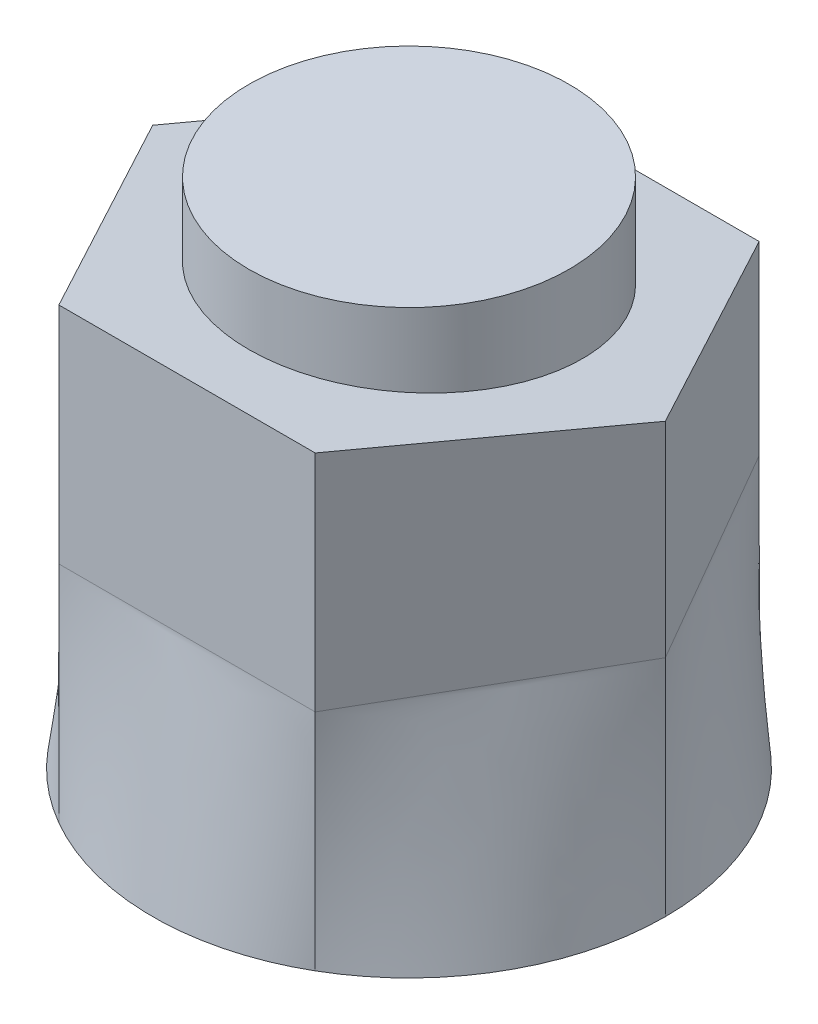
ISO-10303-21;
HEADER;
FILE_DESCRIPTION(('STEP AP214'),'2;1');
FILE_NAME('part.step','',(''),(''),'','','');
FILE_SCHEMA(('AUTOMOTIVE_DESIGN { 1 0 10303 214 1 1 1 1 }'));
ENDSEC;
DATA;
#1=APPLICATION_CONTEXT('core data for automotive mechanical design processes');
#2=APPLICATION_PROTOCOL_DEFINITION('international standard','automotive_design',2000,#1);
#3=PRODUCT_CONTEXT('',#1,'mechanical');
#4=PRODUCT('Part','Part','',(#3));
#5=PRODUCT_RELATED_PRODUCT_CATEGORY('part','',(#4));
#6=PRODUCT_DEFINITION_FORMATION('','',#4);
#7=PRODUCT_DEFINITION_CONTEXT('part definition',#1,'design');
#8=PRODUCT_DEFINITION('design','',#6,#7);
#9=PRODUCT_DEFINITION_SHAPE('','',#8);
#10=(LENGTH_UNIT() NAMED_UNIT(*) SI_UNIT(.MILLI.,.METRE.));
#11=(NAMED_UNIT(*) PLANE_ANGLE_UNIT() SI_UNIT($,.RADIAN.));
#12=(NAMED_UNIT(*) SI_UNIT($,.STERADIAN.) SOLID_ANGLE_UNIT());
#13=UNCERTAINTY_MEASURE_WITH_UNIT(LENGTH_MEASURE(1.E-05),#10,'distance_accuracy_value','');
#14=(GEOMETRIC_REPRESENTATION_CONTEXT(3) GLOBAL_UNCERTAINTY_ASSIGNED_CONTEXT((#13)) GLOBAL_UNIT_ASSIGNED_CONTEXT((#10,
#11,#12)) REPRESENTATION_CONTEXT('',''));
#15=CARTESIAN_POINT('',(0.,0.,0.));
#16=DIRECTION('',(0.,0.,1.));
#17=DIRECTION('',(1.,0.,0.));
#18=AXIS2_PLACEMENT_3D('',#15,#16,#17);
#19=CARTESIAN_POINT('',(0.,0.,0.));
#20=DIRECTION('',(0.,1.,0.));
#21=DIRECTION('',(0.,0.,1.));
#22=AXIS2_PLACEMENT_3D('',#19,#20,#21);
#23=PLANE('',#22);
#24=CARTESIAN_POINT('',(0.,0.,0.));
#25=DIRECTION('',(0.,1.,0.));
#26=DIRECTION('',(0.,0.,1.));
#27=AXIS2_PLACEMENT_3D('',#24,#25,#26);
#28=CIRCLE('',#27,40.);
#29=CARTESIAN_POINT('',(19.9999999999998,0.,-34.6410161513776));
#30=VERTEX_POINT('',#29);
#31=CARTESIAN_POINT('',(-20.0000000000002,0.,-34.6410161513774));
#32=VERTEX_POINT('',#31);
#33=EDGE_CURVE('E302',#30,#32,#28,.T.);
#34=ORIENTED_EDGE('',*,*,#33,.F.);
#35=CARTESIAN_POINT('',(40.,0.,0.));
#36=VERTEX_POINT('',#35);
#37=EDGE_CURVE('E182',#36,#30,#28,.T.);
#38=ORIENTED_EDGE('',*,*,#37,.F.);
#39=CARTESIAN_POINT('',(20.0000000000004,0.,34.6410161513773));
#40=VERTEX_POINT('',#39);
#41=EDGE_CURVE('E284',#40,#36,#28,.T.);
#42=ORIENTED_EDGE('',*,*,#41,.F.);
#43=CARTESIAN_POINT('',(-19.9999999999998,0.,34.6410161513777));
#44=VERTEX_POINT('',#43);
#45=EDGE_CURVE('E292',#44,#40,#28,.T.);
#46=ORIENTED_EDGE('',*,*,#45,.F.);
#47=CARTESIAN_POINT('',(-40.,0.,2.05814939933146E-13));
#48=VERTEX_POINT('',#47);
#49=EDGE_CURVE('E307',#48,#44,#28,.T.);
#50=ORIENTED_EDGE('',*,*,#49,.F.);
#51=EDGE_CURVE('E306',#32,#48,#28,.T.);
#52=ORIENTED_EDGE('',*,*,#51,.F.);
#53=EDGE_LOOP('',(#34,#38,#42,#46,#50,#52));
#54=FACE_BOUND('',#53,.T.);
#55=ADVANCED_FACE('F81',(#54),#23,.F.);
#56=CARTESIAN_POINT('',(-40.,0.,2.05814939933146E-13));
#57=CARTESIAN_POINT('',(-40.,35.,2.77555756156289E-13));
#58=CARTESIAN_POINT('',(-40.,0.,1.66666666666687));
#59=CARTESIAN_POINT('',(-39.1666666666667,35.,1.44337567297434));
#60=CARTESIAN_POINT('',(-39.8954654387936,0.,3.36152931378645));
#61=CARTESIAN_POINT('',(-38.3333333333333,35.,2.88675134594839));
#62=CARTESIAN_POINT('',(-39.4606647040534,0.,6.76786399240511));
#63=CARTESIAN_POINT('',(-36.6666666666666,35.,5.77350269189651));
#64=CARTESIAN_POINT('',(-39.1303205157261,0.,8.47923612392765));
#65=CARTESIAN_POINT('',(-35.8333333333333,35.,7.21687836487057));
#66=CARTESIAN_POINT('',(-38.2374342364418,0.,11.8734178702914));
#67=CARTESIAN_POINT('',(-34.1666666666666,35.,10.1036297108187));
#68=CARTESIAN_POINT('',(-37.6748556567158,0.,13.5560972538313));
#69=CARTESIAN_POINT('',(-33.3333333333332,35.,11.5470053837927));
#70=CARTESIAN_POINT('',(-36.3232199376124,0.,16.8459554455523));
#71=CARTESIAN_POINT('',(-31.6666666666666,35.,14.4337567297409));
#72=CARTESIAN_POINT('',(-35.5341801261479,0.,18.4529946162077));
#73=CARTESIAN_POINT('',(-30.8333333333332,35.,15.8771324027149));
#74=CARTESIAN_POINT('',(-33.747852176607,0.,21.5470053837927));
#75=CARTESIAN_POINT('',(-29.1666666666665,35.,18.763883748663));
#76=CARTESIAN_POINT('',(-32.750635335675,0.,23.033853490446));
#77=CARTESIAN_POINT('',(-28.3333333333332,35.,20.2072594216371));
#78=CARTESIAN_POINT('',(-30.5773524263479,0.,25.8493334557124));
#79=CARTESIAN_POINT('',(-26.6666666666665,35.,23.0940107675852));
#80=CARTESIAN_POINT('',(-29.4013986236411,0.,27.1778804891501));
#81=CARTESIAN_POINT('',(-25.8333333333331,35.,24.5373864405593));
#82=CARTESIAN_POINT('',(-26.9083941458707,0.,29.6482335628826));
#83=CARTESIAN_POINT('',(-24.1666666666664,35.,27.4241377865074));
#84=CARTESIAN_POINT('',(-25.5914744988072,0.,30.790006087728));
#85=CARTESIAN_POINT('',(-23.3333333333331,35.,28.8675134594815));
#86=CARTESIAN_POINT('',(-22.8589025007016,0.,32.8697219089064));
#87=CARTESIAN_POINT('',(-21.6666666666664,35.,31.7542648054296));
#88=CARTESIAN_POINT('',(-21.4433756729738,0.,33.8076828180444));
#89=CARTESIAN_POINT('',(-20.833333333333,35.,33.1976404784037));
#90=CARTESIAN_POINT('',(-19.9999999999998,0.,34.6410161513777));
#91=CARTESIAN_POINT('',(-19.9999999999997,35.,34.6410161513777));
#92=B_SPLINE_SURFACE_WITH_KNOTS('',3,1,((#56,#57),(#58,#59),(#60,#61),(#62,#63),(#64,#65),(#66,
#67),(#68,#69),(#70,#71),(#72,#73),(#74,#75),(#76,#77),(#78,#79),(#80,#81),(#82,#83),(#84,#85),
(#86,#87),(#88,#89),(#90,#91)),.UNSPECIFIED.,.F.,.F.,.F.,(4,2,2,2,2,2,2,2,4),(2,2),(0.,0.125,
0.25,0.375,0.5,0.625,0.75,0.875,1.),(0.,1.),.UNSPECIFIED.);
#93=DIRECTION('',(0.,1.,0.));
#94=VECTOR('',#93,1.);
#95=CARTESIAN_POINT('',(-19.9999999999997,17.5,34.6410161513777));
#96=LINE('',#95,#94);
#97=CARTESIAN_POINT('',(-19.9999999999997,35.,34.6410161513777));
#98=VERTEX_POINT('',#97);
#99=EDGE_CURVE('E98',#44,#98,#96,.T.);
#100=DIRECTION('',(0.500000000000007,0.,0.866025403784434));
#101=VECTOR('',#100,1.);
#102=CARTESIAN_POINT('',(-40.,35.,2.77555756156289E-13));
#103=LINE('',#102,#101);
#104=CARTESIAN_POINT('',(-40.,35.,2.77555756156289E-13));
#105=VERTEX_POINT('',#104);
#106=EDGE_CURVE('E330',#105,#98,#103,.T.);
#107=DIRECTION('',(0.,-1.,0.));
#108=VECTOR('',#107,1.);
#109=CARTESIAN_POINT('',(-40.,17.5,2.41685348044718E-13));
#110=LINE('',#109,#108);
#111=EDGE_CURVE('E317',#105,#48,#110,.T.);
#112=ORIENTED_EDGE('',*,*,#49,.T.);
#113=ORIENTED_EDGE('',*,*,#99,.T.);
#114=ORIENTED_EDGE('',*,*,#106,.F.);
#115=ORIENTED_EDGE('',*,*,#111,.T.);
#116=EDGE_LOOP('',(#112,#113,#114,#115));
#117=FACE_BOUND('',#116,.T.);
#118=ADVANCED_FACE('F246',(#117),#92,.T.);
#119=CARTESIAN_POINT('',(-19.9999999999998,0.,34.6410161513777));
#120=CARTESIAN_POINT('',(-19.9999999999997,35.,34.6410161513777));
#121=CARTESIAN_POINT('',(-18.5566243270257,0.,35.474349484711));
#122=CARTESIAN_POINT('',(-18.333333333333,35.,34.6410161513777));
#123=CARTESIAN_POINT('',(-17.0365629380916,0.,36.2312512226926));
#124=CARTESIAN_POINT('',(-16.6666666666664,35.,34.6410161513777));
#125=CARTESIAN_POINT('',(-13.8691902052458,0.,37.5578700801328));
#126=CARTESIAN_POINT('',(-13.333333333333,35.,34.6410161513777));
#127=CARTESIAN_POINT('',(-12.2219263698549,0.,38.12746968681));
#128=CARTESIAN_POINT('',(-11.6666666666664,35.,34.6410161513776));
#129=CARTESIAN_POINT('',(-8.83603561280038,0.,39.0512983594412));
#130=CARTESIAN_POINT('',(-8.33333333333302,35.,34.6410161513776));
#131=CARTESIAN_POINT('',(-7.09750323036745,0.,39.4054307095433));
#132=CARTESIAN_POINT('',(-6.66666666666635,35.,34.6410161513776));
#133=CARTESIAN_POINT('',(-3.57258460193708,0.,39.8798089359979));
#134=CARTESIAN_POINT('',(-3.33333333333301,35.,34.6410161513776));
#135=CARTESIAN_POINT('',(-1.78632794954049,0.,40.));
#136=CARTESIAN_POINT('',(-1.66666666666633,35.,34.6410161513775));
#137=CARTESIAN_POINT('',(1.78632794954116,0.,40.));
#138=CARTESIAN_POINT('',(1.66666666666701,35.,34.6410161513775));
#139=CARTESIAN_POINT('',(3.57258460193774,0.,39.8798089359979));
#140=CARTESIAN_POINT('',(3.33333333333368,35.,34.6410161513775));
#141=CARTESIAN_POINT('',(7.09750323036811,0.,39.4054307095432));
#142=CARTESIAN_POINT('',(6.66666666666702,35.,34.6410161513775));
#143=CARTESIAN_POINT('',(8.83603561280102,0.,39.051298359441));
#144=CARTESIAN_POINT('',(8.33333333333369,35.,34.6410161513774));
#145=CARTESIAN_POINT('',(12.2219263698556,0.,38.1274696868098));
#146=CARTESIAN_POINT('',(11.666666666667,35.,34.6410161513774));
#147=CARTESIAN_POINT('',(13.8691902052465,0.,37.5578700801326));
#148=CARTESIAN_POINT('',(13.3333333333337,35.,34.6410161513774));
#149=CARTESIAN_POINT('',(17.0365629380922,0.,36.2312512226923));
#150=CARTESIAN_POINT('',(16.6666666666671,35.,34.6410161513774));
#151=CARTESIAN_POINT('',(18.5566243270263,0.,35.4743494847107));
#152=CARTESIAN_POINT('',(18.3333333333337,35.,34.6410161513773));
#153=CARTESIAN_POINT('',(20.0000000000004,0.,34.6410161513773));
#154=CARTESIAN_POINT('',(20.0000000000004,35.,34.6410161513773));
#155=B_SPLINE_SURFACE_WITH_KNOTS('',3,1,((#119,#120),(#121,#122),(#123,#124),(#125,#126),(#127,
#128),(#129,#130),(#131,#132),(#133,#134),(#135,#136),(#137,#138),(#139,#140),(#141,#142),(#143,
#144),(#145,#146),(#147,#148),(#149,#150),(#151,#152),(#153,#154)),.UNSPECIFIED.,.F.,.F.,.F.,(4,
2,2,2,2,2,2,2,4),(2,2),(0.,0.125,0.25,0.375,0.5,0.625,0.75,0.875,1.),(0.,1.),.UNSPECIFIED.);
#156=DIRECTION('',(0.,1.,0.));
#157=VECTOR('',#156,1.);
#158=CARTESIAN_POINT('',(20.0000000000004,17.5,34.6410161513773));
#159=LINE('',#158,#157);
#160=CARTESIAN_POINT('',(20.0000000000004,35.,34.6410161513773));
#161=VERTEX_POINT('',#160);
#162=EDGE_CURVE('E126',#40,#161,#159,.T.);
#163=DIRECTION('',(1.,0.,0.));
#164=VECTOR('',#163,1.);
#165=CARTESIAN_POINT('',(-19.9999999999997,35.,34.6410161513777));
#166=LINE('',#165,#164);
#167=EDGE_CURVE('E90',#98,#161,#166,.T.);
#168=ORIENTED_EDGE('',*,*,#45,.T.);
#169=ORIENTED_EDGE('',*,*,#162,.T.);
#170=ORIENTED_EDGE('',*,*,#167,.F.);
#171=ORIENTED_EDGE('',*,*,#99,.F.);
#172=EDGE_LOOP('',(#168,#169,#170,#171));
#173=FACE_BOUND('',#172,.T.);
#174=ADVANCED_FACE('F354',(#173),#155,.T.);
#175=CARTESIAN_POINT('',(-20.0000000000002,0.,-34.6410161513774));
#176=CARTESIAN_POINT('',(-20.0000000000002,35.,-34.6410161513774));
#177=CARTESIAN_POINT('',(-21.4433756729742,0.,-33.8076828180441));
#178=CARTESIAN_POINT('',(-20.8333333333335,35.,-33.1976404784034));
#179=CARTESIAN_POINT('',(-22.858902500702,0.,-32.8697219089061));
#180=CARTESIAN_POINT('',(-21.6666666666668,35.,-31.7542648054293));
#181=CARTESIAN_POINT('',(-25.5914744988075,0.,-30.7900060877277));
#182=CARTESIAN_POINT('',(-23.3333333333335,35.,-28.8675134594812));
#183=CARTESIAN_POINT('',(-26.9083941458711,0.,-29.6482335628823));
#184=CARTESIAN_POINT('',(-24.1666666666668,35.,-27.4241377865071));
#185=CARTESIAN_POINT('',(-29.4013986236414,0.,-27.1778804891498));
#186=CARTESIAN_POINT('',(-25.8333333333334,35.,-24.5373864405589));
#187=CARTESIAN_POINT('',(-30.5773524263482,0.,-25.8493334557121));
#188=CARTESIAN_POINT('',(-26.6666666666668,35.,-23.0940107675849));
#189=CARTESIAN_POINT('',(-32.7506353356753,0.,-23.0338534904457));
#190=CARTESIAN_POINT('',(-28.3333333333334,35.,-20.2072594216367));
#191=CARTESIAN_POINT('',(-33.7478521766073,0.,-21.5470053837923));
#192=CARTESIAN_POINT('',(-29.1666666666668,35.,-18.7638837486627));
#193=CARTESIAN_POINT('',(-35.5341801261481,0.,-18.4529946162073));
#194=CARTESIAN_POINT('',(-30.8333333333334,35.,-15.8771324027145));
#195=CARTESIAN_POINT('',(-36.3232199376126,0.,-16.8459554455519));
#196=CARTESIAN_POINT('',(-31.6666666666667,35.,-14.4337567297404));
#197=CARTESIAN_POINT('',(-37.6748556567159,0.,-13.5560972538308));
#198=CARTESIAN_POINT('',(-33.3333333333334,35.,-11.5470053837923));
#199=CARTESIAN_POINT('',(-38.237434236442,0.,-11.873417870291));
#200=CARTESIAN_POINT('',(-34.1666666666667,35.,-10.1036297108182));
#201=CARTESIAN_POINT('',(-39.1303205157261,0.,-8.47923612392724));
#202=CARTESIAN_POINT('',(-35.8333333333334,35.,-7.21687836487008));
#203=CARTESIAN_POINT('',(-39.4606647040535,0.,-6.7678639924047));
#204=CARTESIAN_POINT('',(-36.6666666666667,35.,-5.77350269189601));
#205=CARTESIAN_POINT('',(-39.8954654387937,0.,-3.36152931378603));
#206=CARTESIAN_POINT('',(-38.3333333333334,35.,-2.88675134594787));
#207=CARTESIAN_POINT('',(-40.,0.,-1.66666666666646));
#208=CARTESIAN_POINT('',(-39.1666666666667,35.,-1.4433756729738));
#209=CARTESIAN_POINT('',(-40.,0.,2.10255832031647E-13));
#210=CARTESIAN_POINT('',(-40.,35.,2.70616862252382E-13));
#211=B_SPLINE_SURFACE_WITH_KNOTS('',3,1,((#175,#176),(#177,#178),(#179,#180),(#181,#182),(#183,
#184),(#185,#186),(#187,#188),(#189,#190),(#191,#192),(#193,#194),(#195,#196),(#197,#198),(#199,
#200),(#201,#202),(#203,#204),(#205,#206),(#207,#208),(#209,#210)),.UNSPECIFIED.,.F.,.F.,.F.,(4,
2,2,2,2,2,2,2,4),(2,2),(0.,0.125,0.25,0.375,0.5,0.625,0.75,0.875,1.),(0.,1.),.UNSPECIFIED.);
#212=DIRECTION('',(-0.499999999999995,0.,0.866025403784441));
#213=VECTOR('',#212,1.);
#214=CARTESIAN_POINT('',(-20.0000000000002,35.,-34.6410161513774));
#215=LINE('',#214,#213);
#216=CARTESIAN_POINT('',(-20.0000000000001,35.,-34.6410161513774));
#217=VERTEX_POINT('',#216);
#218=EDGE_CURVE('E169',#217,#105,#215,.T.);
#219=DIRECTION('',(0.,1.,0.));
#220=VECTOR('',#219,1.);
#221=CARTESIAN_POINT('',(-20.0000000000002,17.5,-34.6410161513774));
#222=LINE('',#221,#220);
#223=EDGE_CURVE('E163',#32,#217,#222,.T.);
#224=ORIENTED_EDGE('',*,*,#51,.T.);
#225=ORIENTED_EDGE('',*,*,#111,.F.);
#226=ORIENTED_EDGE('',*,*,#218,.F.);
#227=ORIENTED_EDGE('',*,*,#223,.F.);
#228=EDGE_LOOP('',(#224,#225,#226,#227));
#229=FACE_BOUND('',#228,.T.);
#230=ADVANCED_FACE('F342',(#229),#211,.T.);
#231=CARTESIAN_POINT('',(20.0000000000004,0.,34.6410161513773));
#232=CARTESIAN_POINT('',(20.0000000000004,35.,34.6410161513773));
#233=CARTESIAN_POINT('',(21.4433756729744,0.,33.807682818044));
#234=CARTESIAN_POINT('',(20.8333333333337,35.,33.1976404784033));
#235=CARTESIAN_POINT('',(22.8589025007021,0.,32.869721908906));
#236=CARTESIAN_POINT('',(21.666666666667,35.,31.7542648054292));
#237=CARTESIAN_POINT('',(25.5914744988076,0.,30.7900060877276));
#238=CARTESIAN_POINT('',(23.3333333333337,35.,28.8675134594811));
#239=CARTESIAN_POINT('',(26.9083941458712,0.,29.6482335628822));
#240=CARTESIAN_POINT('',(24.166666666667,35.,27.4241377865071));
#241=CARTESIAN_POINT('',(29.4013986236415,0.,27.1778804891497));
#242=CARTESIAN_POINT('',(25.8333333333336,35.,24.5373864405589));
#243=CARTESIAN_POINT('',(30.5773524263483,0.,25.849333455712));
#244=CARTESIAN_POINT('',(26.6666666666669,35.,23.0940107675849));
#245=CARTESIAN_POINT('',(32.7506353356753,0.,23.0338534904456));
#246=CARTESIAN_POINT('',(28.3333333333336,35.,20.2072594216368));
#247=CARTESIAN_POINT('',(33.7478521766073,0.,21.5470053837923));
#248=CARTESIAN_POINT('',(29.1666666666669,35.,18.7638837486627));
#249=CARTESIAN_POINT('',(35.5341801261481,0.,18.4529946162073));
#250=CARTESIAN_POINT('',(30.8333333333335,35.,15.8771324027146));
#251=CARTESIAN_POINT('',(36.3232199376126,0.,16.8459554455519));
#252=CARTESIAN_POINT('',(31.6666666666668,35.,14.4337567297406));
#253=CARTESIAN_POINT('',(37.6748556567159,0.,13.5560972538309));
#254=CARTESIAN_POINT('',(33.3333333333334,35.,11.5470053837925));
#255=CARTESIAN_POINT('',(38.237434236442,0.,11.873417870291));
#256=CARTESIAN_POINT('',(34.1666666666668,35.,10.1036297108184));
#257=CARTESIAN_POINT('',(39.1303205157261,0.,8.47923612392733));
#258=CARTESIAN_POINT('',(35.8333333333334,35.,7.21687836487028));
#259=CARTESIAN_POINT('',(39.4606647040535,0.,6.7678639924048));
#260=CARTESIAN_POINT('',(36.6666666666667,35.,5.77350269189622));
#261=CARTESIAN_POINT('',(39.8954654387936,0.,3.36152931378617));
#262=CARTESIAN_POINT('',(38.3333333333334,35.,2.88675134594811));
#263=CARTESIAN_POINT('',(40.,0.,1.66666666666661));
#264=CARTESIAN_POINT('',(39.1666666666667,35.,1.44337567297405));
#265=CARTESIAN_POINT('',(40.,0.,0.));
#266=CARTESIAN_POINT('',(40.,35.,0.));
#267=B_SPLINE_SURFACE_WITH_KNOTS('',3,1,((#231,#232),(#233,#234),(#235,#236),(#237,#238),(#239,
#240),(#241,#242),(#243,#244),(#245,#246),(#247,#248),(#249,#250),(#251,#252),(#253,#254),(#255,
#256),(#257,#258),(#259,#260),(#261,#262),(#263,#264),(#265,#266)),.UNSPECIFIED.,.F.,.F.,.F.,(4,
2,2,2,2,2,2,2,4),(2,2),(0.,0.125,0.25,0.375,0.5,0.625,0.75,0.875,1.),(0.,1.),.UNSPECIFIED.);
#268=DIRECTION('',(0.,1.,0.));
#269=VECTOR('',#268,1.);
#270=CARTESIAN_POINT('',(40.,17.5,0.));
#271=LINE('',#270,#269);
#272=CARTESIAN_POINT('',(40.,35.,0.));
#273=VERTEX_POINT('',#272);
#274=EDGE_CURVE('E184',#36,#273,#271,.T.);
#275=DIRECTION('',(0.499999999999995,0.,-0.866025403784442));
#276=VECTOR('',#275,1.);
#277=CARTESIAN_POINT('',(20.0000000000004,35.,34.6410161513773));
#278=LINE('',#277,#276);
#279=EDGE_CURVE('E193',#161,#273,#278,.T.);
#280=ORIENTED_EDGE('',*,*,#41,.T.);
#281=ORIENTED_EDGE('',*,*,#274,.T.);
#282=ORIENTED_EDGE('',*,*,#279,.F.);
#283=ORIENTED_EDGE('',*,*,#162,.F.);
#284=EDGE_LOOP('',(#280,#281,#282,#283));
#285=FACE_BOUND('',#284,.T.);
#286=ADVANCED_FACE('F353',(#285),#267,.T.);
#287=CARTESIAN_POINT('',(40.,0.,0.));
#288=CARTESIAN_POINT('',(40.,35.,0.));
#289=CARTESIAN_POINT('',(40.,0.,-1.66666666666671));
#290=CARTESIAN_POINT('',(39.1666666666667,35.,-1.44337567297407));
#291=CARTESIAN_POINT('',(39.8954654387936,0.,-3.36152931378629));
#292=CARTESIAN_POINT('',(38.3333333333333,35.,-2.88675134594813));
#293=CARTESIAN_POINT('',(39.4606647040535,0.,-6.76786399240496));
#294=CARTESIAN_POINT('',(36.6666666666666,35.,-5.77350269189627));
#295=CARTESIAN_POINT('',(39.1303205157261,0.,-8.47923612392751));
#296=CARTESIAN_POINT('',(35.8333333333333,35.,-7.21687836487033));
#297=CARTESIAN_POINT('',(38.2374342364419,0.,-11.8734178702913));
#298=CARTESIAN_POINT('',(34.1666666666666,35.,-10.1036297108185));
#299=CARTESIAN_POINT('',(37.6748556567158,0.,-13.5560972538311));
#300=CARTESIAN_POINT('',(33.3333333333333,35.,-11.5470053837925));
#301=CARTESIAN_POINT('',(36.3232199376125,0.,-16.8459554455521));
#302=CARTESIAN_POINT('',(31.6666666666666,35.,-14.4337567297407));
#303=CARTESIAN_POINT('',(35.5341801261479,0.,-18.4529946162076));
#304=CARTESIAN_POINT('',(30.8333333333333,35.,-15.8771324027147));
#305=CARTESIAN_POINT('',(33.7478521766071,0.,-21.5470053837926));
#306=CARTESIAN_POINT('',(29.1666666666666,35.,-18.7638837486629));
#307=CARTESIAN_POINT('',(32.7506353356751,0.,-23.033853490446));
#308=CARTESIAN_POINT('',(28.3333333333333,35.,-20.2072594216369));
#309=CARTESIAN_POINT('',(30.577352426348,0.,-25.8493334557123));
#310=CARTESIAN_POINT('',(26.6666666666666,35.,-23.0940107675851));
#311=CARTESIAN_POINT('',(29.4013986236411,0.,-27.1778804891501));
#312=CARTESIAN_POINT('',(25.8333333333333,35.,-24.5373864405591));
#313=CARTESIAN_POINT('',(26.9083941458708,0.,-29.6482335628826));
#314=CARTESIAN_POINT('',(24.1666666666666,35.,-27.4241377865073));
#315=CARTESIAN_POINT('',(25.5914744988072,0.,-30.7900060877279));
#316=CARTESIAN_POINT('',(23.3333333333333,35.,-28.8675134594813));
#317=CARTESIAN_POINT('',(22.8589025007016,0.,-32.8697219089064));
#318=CARTESIAN_POINT('',(21.6666666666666,35.,-31.7542648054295));
#319=CARTESIAN_POINT('',(21.4433756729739,0.,-33.8076828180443));
#320=CARTESIAN_POINT('',(20.8333333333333,35.,-33.1976404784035));
#321=CARTESIAN_POINT('',(19.9999999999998,0.,-34.6410161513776));
#322=CARTESIAN_POINT('',(19.9999999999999,35.,-34.6410161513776));
#323=B_SPLINE_SURFACE_WITH_KNOTS('',3,1,((#287,#288),(#289,#290),(#291,#292),(#293,#294),(#295,
#296),(#297,#298),(#299,#300),(#301,#302),(#303,#304),(#305,#306),(#307,#308),(#309,#310),(#311,
#312),(#313,#314),(#315,#316),(#317,#318),(#319,#320),(#321,#322)),.UNSPECIFIED.,.F.,.F.,.F.,(4,
2,2,2,2,2,2,2,4),(2,2),(0.,0.125,0.25,0.375,0.5,0.625,0.75,0.875,1.),(0.,1.),.UNSPECIFIED.);
#324=DIRECTION('',(0.,1.,0.));
#325=VECTOR('',#324,1.);
#326=CARTESIAN_POINT('',(19.9999999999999,17.5,-34.6410161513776));
#327=LINE('',#326,#325);
#328=CARTESIAN_POINT('',(19.9999999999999,35.,-34.6410161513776));
#329=VERTEX_POINT('',#328);
#330=EDGE_CURVE('E162',#30,#329,#327,.T.);
#331=DIRECTION('',(-0.500000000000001,0.,-0.866025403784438));
#332=VECTOR('',#331,1.);
#333=CARTESIAN_POINT('',(40.,35.,0.));
#334=LINE('',#333,#332);
#335=EDGE_CURVE('E170',#273,#329,#334,.T.);
#336=ORIENTED_EDGE('',*,*,#37,.T.);
#337=ORIENTED_EDGE('',*,*,#330,.T.);
#338=ORIENTED_EDGE('',*,*,#335,.F.);
#339=ORIENTED_EDGE('',*,*,#274,.F.);
#340=EDGE_LOOP('',(#336,#337,#338,#339));
#341=FACE_BOUND('',#340,.T.);
#342=ADVANCED_FACE('F177',(#341),#323,.T.);
#343=CARTESIAN_POINT('',(19.9999999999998,0.,-34.6410161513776));
#344=CARTESIAN_POINT('',(19.9999999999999,35.,-34.6410161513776));
#345=CARTESIAN_POINT('',(18.5566243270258,0.,-35.474349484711));
#346=CARTESIAN_POINT('',(18.3333333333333,35.,-34.6410161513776));
#347=CARTESIAN_POINT('',(17.0365629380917,0.,-36.2312512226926));
#348=CARTESIAN_POINT('',(16.6666666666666,35.,-34.6410161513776));
#349=CARTESIAN_POINT('',(13.8691902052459,0.,-37.5578700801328));
#350=CARTESIAN_POINT('',(13.3333333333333,35.,-34.6410161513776));
#351=CARTESIAN_POINT('',(12.221926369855,0.,-38.12746968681));
#352=CARTESIAN_POINT('',(11.6666666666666,35.,-34.6410161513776));
#353=CARTESIAN_POINT('',(8.83603561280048,0.,-39.0512983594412));
#354=CARTESIAN_POINT('',(8.33333333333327,35.,-34.6410161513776));
#355=CARTESIAN_POINT('',(7.09750323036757,0.,-39.4054307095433));
#356=CARTESIAN_POINT('',(6.6666666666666,35.,-34.6410161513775));
#357=CARTESIAN_POINT('',(3.5725846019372,0.,-39.8798089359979));
#358=CARTESIAN_POINT('',(3.33333333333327,35.,-34.6410161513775));
#359=CARTESIAN_POINT('',(1.78632794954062,0.,-40.));
#360=CARTESIAN_POINT('',(1.6666666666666,35.,-34.6410161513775));
#361=CARTESIAN_POINT('',(-1.78632794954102,0.,-40.));
#362=CARTESIAN_POINT('',(-1.66666666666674,35.,-34.6410161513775));
#363=CARTESIAN_POINT('',(-3.5725846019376,0.,-39.8798089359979));
#364=CARTESIAN_POINT('',(-3.33333333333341,35.,-34.6410161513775));
#365=CARTESIAN_POINT('',(-7.09750323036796,0.,-39.4054307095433));
#366=CARTESIAN_POINT('',(-6.66666666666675,35.,-34.6410161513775));
#367=CARTESIAN_POINT('',(-8.83603561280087,0.,-39.0512983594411));
#368=CARTESIAN_POINT('',(-8.33333333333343,35.,-34.6410161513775));
#369=CARTESIAN_POINT('',(-12.2219263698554,0.,-38.1274696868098));
#370=CARTESIAN_POINT('',(-11.6666666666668,35.,-34.6410161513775));
#371=CARTESIAN_POINT('',(-13.8691902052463,0.,-37.5578700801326));
#372=CARTESIAN_POINT('',(-13.3333333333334,35.,-34.6410161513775));
#373=CARTESIAN_POINT('',(-17.0365629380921,0.,-36.2312512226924));
#374=CARTESIAN_POINT('',(-16.6666666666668,35.,-34.6410161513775));
#375=CARTESIAN_POINT('',(-18.5566243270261,0.,-35.4743494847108));
#376=CARTESIAN_POINT('',(-18.3333333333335,35.,-34.6410161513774));
#377=CARTESIAN_POINT('',(-20.0000000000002,0.,-34.6410161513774));
#378=CARTESIAN_POINT('',(-20.0000000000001,35.,-34.6410161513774));
#379=B_SPLINE_SURFACE_WITH_KNOTS('',3,1,((#343,#344),(#345,#346),(#347,#348),(#349,#350),(#351,
#352),(#353,#354),(#355,#356),(#357,#358),(#359,#360),(#361,#362),(#363,#364),(#365,#366),(#367,
#368),(#369,#370),(#371,#372),(#373,#374),(#375,#376),(#377,#378)),.UNSPECIFIED.,.F.,.F.,.F.,(4,
2,2,2,2,2,2,2,4),(2,2),(0.,0.125,0.25,0.375,0.5,0.625,0.75,0.875,1.),(0.,1.),.UNSPECIFIED.);
#380=DIRECTION('',(-1.,0.,0.));
#381=VECTOR('',#380,1.);
#382=CARTESIAN_POINT('',(19.9999999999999,35.,-34.6410161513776));
#383=LINE('',#382,#381);
#384=EDGE_CURVE('E157',#329,#217,#383,.T.);
#385=ORIENTED_EDGE('',*,*,#33,.T.);
#386=ORIENTED_EDGE('',*,*,#223,.T.);
#387=ORIENTED_EDGE('',*,*,#384,.F.);
#388=ORIENTED_EDGE('',*,*,#330,.F.);
#389=EDGE_LOOP('',(#385,#386,#387,#388));
#390=FACE_BOUND('',#389,.T.);
#391=ADVANCED_FACE('F161',(#390),#379,.T.);
#392=CARTESIAN_POINT('',(20.0000000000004,70.,34.6410161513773));
#393=DIRECTION('',(-0.866025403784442,0.,-0.499999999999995));
#394=DIRECTION('',(-0.499999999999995,0.,0.866025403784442));
#395=AXIS2_PLACEMENT_3D('',#392,#393,#394);
#396=PLANE('',#395);
#397=ORIENTED_EDGE('',*,*,#279,.T.);
#398=DIRECTION('',(0.,-1.,0.));
#399=VECTOR('',#398,1.);
#400=CARTESIAN_POINT('',(40.,70.,0.));
#401=LINE('',#400,#399);
#402=CARTESIAN_POINT('',(40.,66.9693037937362,0.));
#403=VERTEX_POINT('',#402);
#404=EDGE_CURVE('E191',#403,#273,#401,.T.);
#405=ORIENTED_EDGE('',*,*,#404,.F.);
#406=DIRECTION('',(0.498570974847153,-0.0755508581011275,-0.863550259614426));
#407=VECTOR('',#406,1.);
#408=CARTESIAN_POINT('',(20.0000000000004,70.,34.6410161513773));
#409=LINE('',#408,#407);
#410=CARTESIAN_POINT('',(20.0000000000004,70.,34.6410161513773));
#411=VERTEX_POINT('',#410);
#412=EDGE_CURVE('E432',#411,#403,#409,.T.);
#413=ORIENTED_EDGE('',*,*,#412,.F.);
#414=DIRECTION('',(0.,-1.,0.));
#415=VECTOR('',#414,1.);
#416=CARTESIAN_POINT('',(20.0000000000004,70.,34.6410161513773));
#417=LINE('',#416,#415);
#418=EDGE_CURVE('E217',#411,#161,#417,.T.);
#419=ORIENTED_EDGE('',*,*,#418,.T.);
#420=EDGE_LOOP('',(#397,#405,#413,#419));
#421=FACE_BOUND('',#420,.T.);
#422=ADVANCED_FACE('F233',(#421),#396,.F.);
#423=CARTESIAN_POINT('',(40.,70.,0.));
#424=DIRECTION('',(-0.866025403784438,0.,0.500000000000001));
#425=DIRECTION('',(0.500000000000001,0.,0.866025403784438));
#426=AXIS2_PLACEMENT_3D('',#423,#424,#425);
#427=PLANE('',#426);
#428=ORIENTED_EDGE('',*,*,#335,.T.);
#429=DIRECTION('',(0.,-1.,0.));
#430=VECTOR('',#429,1.);
#431=CARTESIAN_POINT('',(19.9999999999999,70.,-34.6410161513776));
#432=LINE('',#431,#430);
#433=CARTESIAN_POINT('',(19.9999999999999,63.9386075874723,-34.6410161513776));
#434=VERTEX_POINT('',#433);
#435=EDGE_CURVE('E188',#434,#329,#432,.T.);
#436=ORIENTED_EDGE('',*,*,#435,.F.);
#437=DIRECTION('',(-0.498570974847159,-0.0755508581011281,-0.863550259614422));
#438=VECTOR('',#437,1.);
#439=CARTESIAN_POINT('',(40.1141586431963,66.9866028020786,0.197728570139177));
#440=LINE('',#439,#438);
#441=EDGE_CURVE('E116',#403,#434,#440,.T.);
#442=ORIENTED_EDGE('',*,*,#441,.F.);
#443=ORIENTED_EDGE('',*,*,#404,.T.);
#444=EDGE_LOOP('',(#428,#436,#442,#443));
#445=FACE_BOUND('',#444,.T.);
#446=ADVANCED_FACE('F187',(#445),#427,.F.);
#447=CARTESIAN_POINT('',(19.9999999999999,70.,-34.6410161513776));
#448=DIRECTION('',(0.,0.,1.));
#449=DIRECTION('',(1.,0.,0.));
#450=AXIS2_PLACEMENT_3D('',#447,#448,#449);
#451=PLANE('',#450);
#452=ORIENTED_EDGE('',*,*,#384,.T.);
#453=DIRECTION('',(0.,-1.,0.));
#454=VECTOR('',#453,1.);
#455=CARTESIAN_POINT('',(-20.0000000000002,70.,-34.6410161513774));
#456=LINE('',#455,#454);
#457=CARTESIAN_POINT('',(-20.0000000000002,63.9386075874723,-34.6410161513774));
#458=VERTEX_POINT('',#457);
#459=EDGE_CURVE('E199',#458,#217,#456,.T.);
#460=ORIENTED_EDGE('',*,*,#459,.F.);
#461=DIRECTION('',(-1.,0.,0.));
#462=VECTOR('',#461,1.);
#463=CARTESIAN_POINT('',(19.9999999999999,63.9386075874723,-34.6410161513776));
#464=LINE('',#463,#462);
#465=EDGE_CURVE('E198',#434,#458,#464,.T.);
#466=ORIENTED_EDGE('',*,*,#465,.F.);
#467=ORIENTED_EDGE('',*,*,#435,.T.);
#468=EDGE_LOOP('',(#452,#460,#466,#467));
#469=FACE_BOUND('',#468,.T.);
#470=ADVANCED_FACE('F197',(#469),#451,.F.);
#471=CARTESIAN_POINT('',(-20.0000000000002,70.,-34.6410161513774));
#472=DIRECTION('',(0.866025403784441,0.,0.499999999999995));
#473=DIRECTION('',(0.499999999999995,0.,-0.866025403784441));
#474=AXIS2_PLACEMENT_3D('',#471,#472,#473);
#475=PLANE('',#474);
#476=ORIENTED_EDGE('',*,*,#218,.T.);
#477=DIRECTION('',(0.,-1.,0.));
#478=VECTOR('',#477,1.);
#479=CARTESIAN_POINT('',(-40.,70.,2.79318507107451E-13));
#480=LINE('',#479,#478);
#481=CARTESIAN_POINT('',(-40.,66.9693037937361,2.79318507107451E-13));
#482=VERTEX_POINT('',#481);
#483=EDGE_CURVE('E202',#482,#105,#480,.T.);
#484=ORIENTED_EDGE('',*,*,#483,.F.);
#485=DIRECTION('',(-0.498570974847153,0.0755508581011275,0.863550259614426));
#486=VECTOR('',#485,1.);
#487=CARTESIAN_POINT('',(-20.2283172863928,63.973205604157,-34.2455590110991));
#488=LINE('',#487,#486);
#489=EDGE_CURVE('E437',#458,#482,#488,.T.);
#490=ORIENTED_EDGE('',*,*,#489,.F.);
#491=ORIENTED_EDGE('',*,*,#459,.T.);
#492=EDGE_LOOP('',(#476,#484,#490,#491));
#493=FACE_BOUND('',#492,.T.);
#494=ADVANCED_FACE('F497',(#493),#475,.F.);
#495=CARTESIAN_POINT('',(-40.,70.,2.79318507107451E-13));
#496=DIRECTION('',(0.866025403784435,0.,-0.500000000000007));
#497=DIRECTION('',(-0.500000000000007,0.,-0.866025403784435));
#498=AXIS2_PLACEMENT_3D('',#495,#496,#497);
#499=PLANE('',#498);
#500=ORIENTED_EDGE('',*,*,#106,.T.);
#501=DIRECTION('',(0.,-1.,0.));
#502=VECTOR('',#501,1.);
#503=CARTESIAN_POINT('',(-19.9999999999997,70.,34.6410161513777));
#504=LINE('',#503,#502);
#505=CARTESIAN_POINT('',(-19.9999999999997,70.,34.6410161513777));
#506=VERTEX_POINT('',#505);
#507=EDGE_CURVE('E429',#506,#98,#504,.T.);
#508=ORIENTED_EDGE('',*,*,#507,.F.);
#509=DIRECTION('',(0.498570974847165,0.0755508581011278,0.863550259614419));
#510=VECTOR('',#509,1.);
#511=CARTESIAN_POINT('',(-39.8858413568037,66.9866028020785,0.197728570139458));
#512=LINE('',#511,#510);
#513=EDGE_CURVE('E435',#482,#506,#512,.T.);
#514=ORIENTED_EDGE('',*,*,#513,.F.);
#515=ORIENTED_EDGE('',*,*,#483,.T.);
#516=EDGE_LOOP('',(#500,#508,#514,#515));
#517=FACE_BOUND('',#516,.T.);
#518=ADVANCED_FACE('F462',(#517),#499,.F.);
#519=CARTESIAN_POINT('',(-19.9999999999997,70.,34.6410161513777));
#520=DIRECTION('',(0.,0.,-1.));
#521=DIRECTION('',(-1.,0.,0.));
#522=AXIS2_PLACEMENT_3D('',#519,#520,#521);
#523=PLANE('',#522);
#524=ORIENTED_EDGE('',*,*,#167,.T.);
#525=ORIENTED_EDGE('',*,*,#418,.F.);
#526=DIRECTION('',(1.,0.,0.));
#527=VECTOR('',#526,1.);
#528=CARTESIAN_POINT('',(-19.9999999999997,70.,34.6410161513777));
#529=LINE('',#528,#527);
#530=EDGE_CURVE('E296',#506,#411,#529,.T.);
#531=ORIENTED_EDGE('',*,*,#530,.F.);
#532=ORIENTED_EDGE('',*,*,#507,.T.);
#533=EDGE_LOOP('',(#524,#525,#531,#532));
#534=FACE_BOUND('',#533,.T.);
#535=ADVANCED_FACE('F425',(#534),#523,.F.);
#536=CARTESIAN_POINT('',(-19.9999999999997,70.,34.6410161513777));
#537=DIRECTION('',(0.,0.996194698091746,-0.0871557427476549));
#538=DIRECTION('',(0.,0.0871557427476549,0.996194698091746));
#539=AXIS2_PLACEMENT_3D('',#536,#537,#538);
#540=PLANE('',#539);
#541=CARTESIAN_POINT('',(0.,66.9693037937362,0.));
#542=DIRECTION('',(0.,0.996194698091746,-0.0871557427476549));
#543=DIRECTION('',(0.,0.0871557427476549,0.996194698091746));
#544=AXIS2_PLACEMENT_3D('',#541,#542,#543);
#545=ELLIPSE('',#544,25.0954959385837,25.);
#546=CARTESIAN_POINT('',(2.60208521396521E-13,69.1565203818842,25.));
#547=VERTEX_POINT('',#546);
#548=EDGE_CURVE('E12',#547,#547,#545,.T.);
#549=ORIENTED_EDGE('',*,*,#548,.F.);
#550=EDGE_LOOP('',(#549));
#551=FACE_BOUND('',#550,.T.);
#552=ORIENTED_EDGE('',*,*,#412,.T.);
#553=ORIENTED_EDGE('',*,*,#441,.T.);
#554=ORIENTED_EDGE('',*,*,#465,.T.);
#555=ORIENTED_EDGE('',*,*,#489,.T.);
#556=ORIENTED_EDGE('',*,*,#513,.T.);
#557=ORIENTED_EDGE('',*,*,#530,.T.);
#558=EDGE_LOOP('',(#552,#553,#554,#555,#556,#557));
#559=FACE_BOUND('',#558,.T.);
#560=ADVANCED_FACE('F83',(#551,#559),#540,.T.);
#561=CARTESIAN_POINT('',(0.,60.,0.));
#562=DIRECTION('',(0.,1.,0.));
#563=DIRECTION('',(0.,0.,1.));
#564=AXIS2_PLACEMENT_3D('',#561,#562,#563);
#565=CYLINDRICAL_SURFACE('',#564,25.);
#566=ORIENTED_EDGE('',*,*,#548,.T.);
#567=EDGE_LOOP('',(#566));
#568=FACE_BOUND('',#567,.T.);
#569=CARTESIAN_POINT('',(0.,80.,0.));
#570=DIRECTION('',(0.,1.,0.));
#571=DIRECTION('',(0.,0.,1.));
#572=AXIS2_PLACEMENT_3D('',#569,#570,#571);
#573=CIRCLE('',#572,25.);
#574=CARTESIAN_POINT('',(0.,80.,25.));
#575=VERTEX_POINT('',#574);
#576=EDGE_CURVE('E442',#575,#575,#573,.T.);
#577=ORIENTED_EDGE('',*,*,#576,.F.);
#578=EDGE_LOOP('',(#577));
#579=FACE_BOUND('',#578,.T.);
#580=ADVANCED_FACE('F448',(#568,#579),#565,.T.);
#581=CARTESIAN_POINT('',(0.,80.,0.));
#582=DIRECTION('',(0.,1.,0.));
#583=DIRECTION('',(0.,0.,1.));
#584=AXIS2_PLACEMENT_3D('',#581,#582,#583);
#585=PLANE('',#584);
#586=ORIENTED_EDGE('',*,*,#576,.T.);
#587=EDGE_LOOP('',(#586));
#588=FACE_BOUND('',#587,.T.);
#589=ADVANCED_FACE('F446',(#588),#585,.T.);
#590=CLOSED_SHELL('',(#55,#118,#174,#230,#286,#342,#391,#422,#446,#470,#494,#518,#535,#560,#580,#589));
#591=MANIFOLD_SOLID_BREP('B2',#590);
#592=ADVANCED_BREP_SHAPE_REPRESENTATION('',(#18,#591),#14);
#593=SHAPE_DEFINITION_REPRESENTATION(#9,#592);
ENDSEC;
END-ISO-10303-21;
